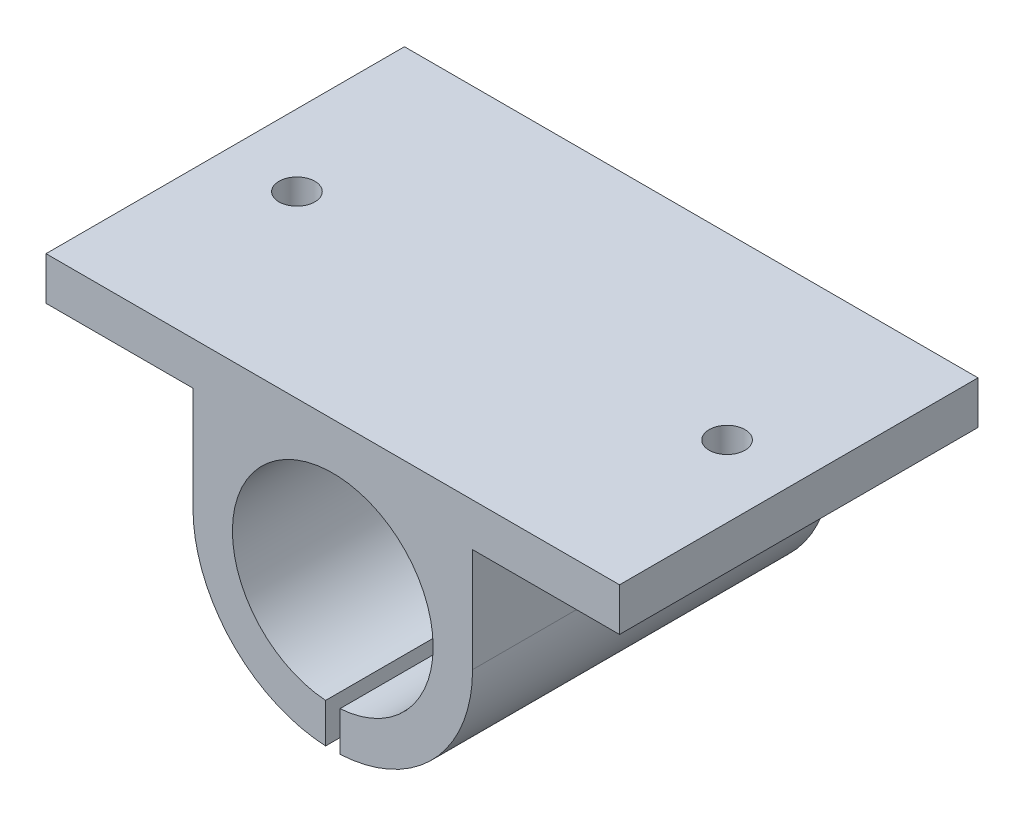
ISO-10303-21;
HEADER;
FILE_DESCRIPTION(('STEP AP214'),'2;1');
FILE_NAME('part.step','',(''),(''),'','','');
FILE_SCHEMA(('AUTOMOTIVE_DESIGN { 1 0 10303 214 1 1 1 1 }'));
ENDSEC;
DATA;
#1=APPLICATION_CONTEXT('core data for automotive mechanical design processes');
#2=APPLICATION_PROTOCOL_DEFINITION('international standard','automotive_design',2000,#1);
#3=PRODUCT_CONTEXT('',#1,'mechanical');
#4=PRODUCT('Part','Part','',(#3));
#5=PRODUCT_RELATED_PRODUCT_CATEGORY('part','',(#4));
#6=PRODUCT_DEFINITION_FORMATION('','',#4);
#7=PRODUCT_DEFINITION_CONTEXT('part definition',#1,'design');
#8=PRODUCT_DEFINITION('design','',#6,#7);
#9=PRODUCT_DEFINITION_SHAPE('','',#8);
#10=(LENGTH_UNIT() NAMED_UNIT(*) SI_UNIT(.MILLI.,.METRE.));
#11=(NAMED_UNIT(*) PLANE_ANGLE_UNIT() SI_UNIT($,.RADIAN.));
#12=(NAMED_UNIT(*) SI_UNIT($,.STERADIAN.) SOLID_ANGLE_UNIT());
#13=UNCERTAINTY_MEASURE_WITH_UNIT(LENGTH_MEASURE(1.E-05),#10,'distance_accuracy_value','');
#14=(GEOMETRIC_REPRESENTATION_CONTEXT(3) GLOBAL_UNCERTAINTY_ASSIGNED_CONTEXT((#13)) GLOBAL_UNIT_ASSIGNED_CONTEXT((#10,
#11,#12)) REPRESENTATION_CONTEXT('',''));
#15=CARTESIAN_POINT('',(0.,0.,0.));
#16=DIRECTION('',(0.,0.,1.));
#17=DIRECTION('',(1.,0.,0.));
#18=AXIS2_PLACEMENT_3D('',#15,#16,#17);
#19=CARTESIAN_POINT('',(0.,0.,25.));
#20=DIRECTION('',(0.,0.,-1.));
#21=DIRECTION('',(-1.,0.,0.));
#22=AXIS2_PLACEMENT_3D('',#19,#20,#21);
#23=CYLINDRICAL_SURFACE('',#22,7.);
#24=CARTESIAN_POINT('',(0.,0.,0.));
#25=DIRECTION('',(0.,0.,-1.));
#26=DIRECTION('',(1.,0.,0.));
#27=AXIS2_PLACEMENT_3D('',#24,#25,#26);
#28=CIRCLE('',#27,7.);
#29=CARTESIAN_POINT('',(-0.499999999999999,-6.98212002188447,0.));
#30=VERTEX_POINT('',#29);
#31=CARTESIAN_POINT('',(0.499999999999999,-6.98212002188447,0.));
#32=VERTEX_POINT('',#31);
#33=EDGE_CURVE('E165',#30,#32,#28,.T.);
#34=ORIENTED_EDGE('',*,*,#33,.T.);
#35=DIRECTION('',(0.,0.,-1.));
#36=VECTOR('',#35,1.);
#37=CARTESIAN_POINT('',(0.499999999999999,-6.98212002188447,25.));
#38=LINE('',#37,#36);
#39=CARTESIAN_POINT('',(0.499999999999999,-6.98212002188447,25.));
#40=VERTEX_POINT('',#39);
#41=EDGE_CURVE('E13',#40,#32,#38,.T.);
#42=ORIENTED_EDGE('',*,*,#41,.F.);
#43=CARTESIAN_POINT('',(0.,0.,25.));
#44=DIRECTION('',(0.,0.,-1.));
#45=DIRECTION('',(1.,0.,0.));
#46=AXIS2_PLACEMENT_3D('',#43,#44,#45);
#47=CIRCLE('',#46,7.);
#48=CARTESIAN_POINT('',(-0.499999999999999,-6.98212002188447,25.));
#49=VERTEX_POINT('',#48);
#50=EDGE_CURVE('E188',#49,#40,#47,.T.);
#51=ORIENTED_EDGE('',*,*,#50,.F.);
#52=DIRECTION('',(0.,0.,-1.));
#53=VECTOR('',#52,1.);
#54=CARTESIAN_POINT('',(-0.499999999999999,-6.98212002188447,25.));
#55=LINE('',#54,#53);
#56=EDGE_CURVE('E161',#49,#30,#55,.T.);
#57=ORIENTED_EDGE('',*,*,#56,.T.);
#58=EDGE_LOOP('',(#34,#42,#51,#57));
#59=FACE_BOUND('',#58,.T.);
#60=ADVANCED_FACE('F44',(#59),#23,.F.);
#61=CARTESIAN_POINT('',(0.499999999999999,-6.98212002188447,25.));
#62=DIRECTION('',(1.,0.,0.));
#63=DIRECTION('',(0.,1.,0.));
#64=AXIS2_PLACEMENT_3D('',#61,#62,#63);
#65=PLANE('',#64);
#66=DIRECTION('',(0.,-1.,0.));
#67=VECTOR('',#66,1.);
#68=CARTESIAN_POINT('',(0.499999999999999,-6.98212002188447,0.));
#69=LINE('',#68,#67);
#70=CARTESIAN_POINT('',(0.499999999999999,-9.73717104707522,0.));
#71=VERTEX_POINT('',#70);
#72=EDGE_CURVE('E168',#32,#71,#69,.T.);
#73=ORIENTED_EDGE('',*,*,#72,.T.);
#74=DIRECTION('',(0.,0.,-1.));
#75=VECTOR('',#74,1.);
#76=CARTESIAN_POINT('',(0.499999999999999,-9.73717104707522,25.));
#77=LINE('',#76,#75);
#78=CARTESIAN_POINT('',(0.499999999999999,-9.73717104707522,25.));
#79=VERTEX_POINT('',#78);
#80=EDGE_CURVE('E53',#79,#71,#77,.T.);
#81=ORIENTED_EDGE('',*,*,#80,.F.);
#82=DIRECTION('',(0.,-1.,0.));
#83=VECTOR('',#82,1.);
#84=CARTESIAN_POINT('',(0.499999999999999,-6.98212002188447,25.));
#85=LINE('',#84,#83);
#86=EDGE_CURVE('E116',#40,#79,#85,.T.);
#87=ORIENTED_EDGE('',*,*,#86,.F.);
#88=ORIENTED_EDGE('',*,*,#41,.T.);
#89=EDGE_LOOP('',(#73,#81,#87,#88));
#90=FACE_BOUND('',#89,.T.);
#91=ADVANCED_FACE('F267',(#90),#65,.F.);
#92=CARTESIAN_POINT('',(0.,0.,25.));
#93=DIRECTION('',(0.,0.,-1.));
#94=DIRECTION('',(-1.,0.,0.));
#95=AXIS2_PLACEMENT_3D('',#92,#93,#94);
#96=CYLINDRICAL_SURFACE('',#95,9.75);
#97=CARTESIAN_POINT('',(0.,0.,0.));
#98=DIRECTION('',(0.,0.,1.));
#99=DIRECTION('',(1.,0.,0.));
#100=AXIS2_PLACEMENT_3D('',#97,#98,#99);
#101=CIRCLE('',#100,9.75);
#102=CARTESIAN_POINT('',(9.75,0.,0.));
#103=VERTEX_POINT('',#102);
#104=EDGE_CURVE('E171',#71,#103,#101,.T.);
#105=ORIENTED_EDGE('',*,*,#104,.T.);
#106=DIRECTION('',(0.,0.,-1.));
#107=VECTOR('',#106,1.);
#108=CARTESIAN_POINT('',(9.75,0.,25.));
#109=LINE('',#108,#107);
#110=CARTESIAN_POINT('',(9.75,0.,25.));
#111=VERTEX_POINT('',#110);
#112=EDGE_CURVE('E207',#111,#103,#109,.T.);
#113=ORIENTED_EDGE('',*,*,#112,.F.);
#114=CARTESIAN_POINT('',(0.,0.,25.));
#115=DIRECTION('',(0.,0.,1.));
#116=DIRECTION('',(1.,0.,0.));
#117=AXIS2_PLACEMENT_3D('',#114,#115,#116);
#118=CIRCLE('',#117,9.75);
#119=EDGE_CURVE('E216',#79,#111,#118,.T.);
#120=ORIENTED_EDGE('',*,*,#119,.F.);
#121=ORIENTED_EDGE('',*,*,#80,.T.);
#122=EDGE_LOOP('',(#105,#113,#120,#121));
#123=FACE_BOUND('',#122,.T.);
#124=ADVANCED_FACE('F214',(#123),#96,.T.);
#125=CARTESIAN_POINT('',(9.75,0.,25.));
#126=DIRECTION('',(-1.,0.,0.));
#127=DIRECTION('',(0.,-1.,0.));
#128=AXIS2_PLACEMENT_3D('',#125,#126,#127);
#129=PLANE('',#128);
#130=DIRECTION('',(0.,1.,0.));
#131=VECTOR('',#130,1.);
#132=CARTESIAN_POINT('',(9.75,0.,0.));
#133=LINE('',#132,#131);
#134=CARTESIAN_POINT('',(9.75,7.25,0.));
#135=VERTEX_POINT('',#134);
#136=EDGE_CURVE('E173',#103,#135,#133,.T.);
#137=ORIENTED_EDGE('',*,*,#136,.T.);
#138=DIRECTION('',(0.,0.,-1.));
#139=VECTOR('',#138,1.);
#140=CARTESIAN_POINT('',(9.75,7.25,25.));
#141=LINE('',#140,#139);
#142=CARTESIAN_POINT('',(9.75,7.25,25.));
#143=VERTEX_POINT('',#142);
#144=EDGE_CURVE('E204',#143,#135,#141,.T.);
#145=ORIENTED_EDGE('',*,*,#144,.F.);
#146=DIRECTION('',(0.,1.,0.));
#147=VECTOR('',#146,1.);
#148=CARTESIAN_POINT('',(9.75,0.,25.));
#149=LINE('',#148,#147);
#150=EDGE_CURVE('E234',#111,#143,#149,.T.);
#151=ORIENTED_EDGE('',*,*,#150,.F.);
#152=ORIENTED_EDGE('',*,*,#112,.T.);
#153=EDGE_LOOP('',(#137,#145,#151,#152));
#154=FACE_BOUND('',#153,.T.);
#155=ADVANCED_FACE('F225',(#154),#129,.F.);
#156=CARTESIAN_POINT('',(9.75,7.25,25.));
#157=DIRECTION('',(0.,1.,0.));
#158=DIRECTION('',(0.,0.,1.));
#159=AXIS2_PLACEMENT_3D('',#156,#157,#158);
#160=PLANE('',#159);
#161=CARTESIAN_POINT('',(15.,7.25,12.5));
#162=DIRECTION('',(0.,1.,0.));
#163=DIRECTION('',(0.,0.,1.));
#164=AXIS2_PLACEMENT_3D('',#161,#162,#163);
#165=CIRCLE('',#164,1.25);
#166=CARTESIAN_POINT('',(15.,7.25,13.75));
#167=VERTEX_POINT('',#166);
#168=EDGE_CURVE('E169',#167,#167,#165,.T.);
#169=ORIENTED_EDGE('',*,*,#168,.T.);
#170=EDGE_LOOP('',(#169));
#171=FACE_BOUND('',#170,.T.);
#172=DIRECTION('',(1.,0.,0.));
#173=VECTOR('',#172,1.);
#174=CARTESIAN_POINT('',(9.75,7.25,0.));
#175=LINE('',#174,#173);
#176=CARTESIAN_POINT('',(20.,7.25,0.));
#177=VERTEX_POINT('',#176);
#178=EDGE_CURVE('E175',#135,#177,#175,.T.);
#179=ORIENTED_EDGE('',*,*,#178,.T.);
#180=DIRECTION('',(0.,0.,-1.));
#181=VECTOR('',#180,1.);
#182=CARTESIAN_POINT('',(20.,7.25,25.));
#183=LINE('',#182,#181);
#184=CARTESIAN_POINT('',(20.,7.25,25.));
#185=VERTEX_POINT('',#184);
#186=EDGE_CURVE('E201',#185,#177,#183,.T.);
#187=ORIENTED_EDGE('',*,*,#186,.F.);
#188=DIRECTION('',(1.,0.,0.));
#189=VECTOR('',#188,1.);
#190=CARTESIAN_POINT('',(9.75,7.25,25.));
#191=LINE('',#190,#189);
#192=EDGE_CURVE('E231',#143,#185,#191,.T.);
#193=ORIENTED_EDGE('',*,*,#192,.F.);
#194=ORIENTED_EDGE('',*,*,#144,.T.);
#195=EDGE_LOOP('',(#179,#187,#193,#194));
#196=FACE_BOUND('',#195,.T.);
#197=ADVANCED_FACE('F229',(#171,#196),#160,.F.);
#198=CARTESIAN_POINT('',(20.,10.25,25.));
#199=DIRECTION('',(-1.,0.,0.));
#200=DIRECTION('',(0.,0.,1.));
#201=AXIS2_PLACEMENT_3D('',#198,#199,#200);
#202=PLANE('',#201);
#203=DIRECTION('',(0.,1.,0.));
#204=VECTOR('',#203,1.);
#205=CARTESIAN_POINT('',(20.,10.25,0.));
#206=LINE('',#205,#204);
#207=CARTESIAN_POINT('',(20.,10.25,0.));
#208=VERTEX_POINT('',#207);
#209=EDGE_CURVE('E177',#177,#208,#206,.T.);
#210=ORIENTED_EDGE('',*,*,#209,.T.);
#211=DIRECTION('',(0.,0.,-1.));
#212=VECTOR('',#211,1.);
#213=CARTESIAN_POINT('',(20.,10.25,25.));
#214=LINE('',#213,#212);
#215=CARTESIAN_POINT('',(20.,10.25,25.));
#216=VERTEX_POINT('',#215);
#217=EDGE_CURVE('E198',#216,#208,#214,.T.);
#218=ORIENTED_EDGE('',*,*,#217,.F.);
#219=DIRECTION('',(0.,1.,0.));
#220=VECTOR('',#219,1.);
#221=CARTESIAN_POINT('',(20.,10.25,25.));
#222=LINE('',#221,#220);
#223=EDGE_CURVE('E233',#185,#216,#222,.T.);
#224=ORIENTED_EDGE('',*,*,#223,.F.);
#225=ORIENTED_EDGE('',*,*,#186,.T.);
#226=EDGE_LOOP('',(#210,#218,#224,#225));
#227=FACE_BOUND('',#226,.T.);
#228=ADVANCED_FACE('F280',(#227),#202,.F.);
#229=CARTESIAN_POINT('',(-20.,10.25,25.));
#230=DIRECTION('',(0.,-1.,0.));
#231=DIRECTION('',(0.,0.,-1.));
#232=AXIS2_PLACEMENT_3D('',#229,#230,#231);
#233=PLANE('',#232);
#234=CARTESIAN_POINT('',(-15.,10.25,12.5));
#235=DIRECTION('',(0.,1.,0.));
#236=DIRECTION('',(0.,0.,1.));
#237=AXIS2_PLACEMENT_3D('',#234,#235,#236);
#238=CIRCLE('',#237,1.25);
#239=CARTESIAN_POINT('',(-15.,10.25,13.75));
#240=VERTEX_POINT('',#239);
#241=EDGE_CURVE('E372',#240,#240,#238,.T.);
#242=ORIENTED_EDGE('',*,*,#241,.F.);
#243=EDGE_LOOP('',(#242));
#244=FACE_BOUND('',#243,.T.);
#245=CARTESIAN_POINT('',(15.,10.25,12.5));
#246=DIRECTION('',(0.,1.,0.));
#247=DIRECTION('',(0.,0.,1.));
#248=AXIS2_PLACEMENT_3D('',#245,#246,#247);
#249=CIRCLE('',#248,1.25);
#250=CARTESIAN_POINT('',(15.,10.25,13.75));
#251=VERTEX_POINT('',#250);
#252=EDGE_CURVE('E367',#251,#251,#249,.T.);
#253=ORIENTED_EDGE('',*,*,#252,.F.);
#254=EDGE_LOOP('',(#253));
#255=FACE_BOUND('',#254,.T.);
#256=DIRECTION('',(-1.,0.,0.));
#257=VECTOR('',#256,1.);
#258=CARTESIAN_POINT('',(-20.,10.25,0.));
#259=LINE('',#258,#257);
#260=CARTESIAN_POINT('',(-20.,10.25,0.));
#261=VERTEX_POINT('',#260);
#262=EDGE_CURVE('E179',#208,#261,#259,.T.);
#263=ORIENTED_EDGE('',*,*,#262,.T.);
#264=DIRECTION('',(0.,0.,-1.));
#265=VECTOR('',#264,1.);
#266=CARTESIAN_POINT('',(-20.,10.25,25.));
#267=LINE('',#266,#265);
#268=CARTESIAN_POINT('',(-20.,10.25,25.));
#269=VERTEX_POINT('',#268);
#270=EDGE_CURVE('E195',#269,#261,#267,.T.);
#271=ORIENTED_EDGE('',*,*,#270,.F.);
#272=DIRECTION('',(-1.,0.,0.));
#273=VECTOR('',#272,1.);
#274=CARTESIAN_POINT('',(-20.,10.25,25.));
#275=LINE('',#274,#273);
#276=EDGE_CURVE('E236',#216,#269,#275,.T.);
#277=ORIENTED_EDGE('',*,*,#276,.F.);
#278=ORIENTED_EDGE('',*,*,#217,.T.);
#279=EDGE_LOOP('',(#263,#271,#277,#278));
#280=FACE_BOUND('',#279,.T.);
#281=ADVANCED_FACE('F284',(#244,#255,#280),#233,.F.);
#282=CARTESIAN_POINT('',(-20.,10.25,25.));
#283=DIRECTION('',(1.,0.,0.));
#284=DIRECTION('',(0.,0.,-1.));
#285=AXIS2_PLACEMENT_3D('',#282,#283,#284);
#286=PLANE('',#285);
#287=DIRECTION('',(0.,-1.,0.));
#288=VECTOR('',#287,1.);
#289=CARTESIAN_POINT('',(-20.,10.25,0.));
#290=LINE('',#289,#288);
#291=CARTESIAN_POINT('',(-20.,7.25,0.));
#292=VERTEX_POINT('',#291);
#293=EDGE_CURVE('E181',#261,#292,#290,.T.);
#294=ORIENTED_EDGE('',*,*,#293,.T.);
#295=DIRECTION('',(0.,0.,-1.));
#296=VECTOR('',#295,1.);
#297=CARTESIAN_POINT('',(-20.,7.25,25.));
#298=LINE('',#297,#296);
#299=CARTESIAN_POINT('',(-20.,7.25,25.));
#300=VERTEX_POINT('',#299);
#301=EDGE_CURVE('E192',#300,#292,#298,.T.);
#302=ORIENTED_EDGE('',*,*,#301,.F.);
#303=DIRECTION('',(0.,-1.,0.));
#304=VECTOR('',#303,1.);
#305=CARTESIAN_POINT('',(-20.,10.25,25.));
#306=LINE('',#305,#304);
#307=EDGE_CURVE('E242',#269,#300,#306,.T.);
#308=ORIENTED_EDGE('',*,*,#307,.F.);
#309=ORIENTED_EDGE('',*,*,#270,.T.);
#310=EDGE_LOOP('',(#294,#302,#308,#309));
#311=FACE_BOUND('',#310,.T.);
#312=ADVANCED_FACE('F248',(#311),#286,.F.);
#313=CARTESIAN_POINT('',(-20.,7.25,25.));
#314=DIRECTION('',(0.,1.,0.));
#315=DIRECTION('',(0.,0.,1.));
#316=AXIS2_PLACEMENT_3D('',#313,#314,#315);
#317=PLANE('',#316);
#318=CARTESIAN_POINT('',(-15.,7.25,12.5));
#319=DIRECTION('',(0.,1.,0.));
#320=DIRECTION('',(0.,0.,1.));
#321=AXIS2_PLACEMENT_3D('',#318,#319,#320);
#322=CIRCLE('',#321,1.25);
#323=CARTESIAN_POINT('',(-15.,7.25,13.75));
#324=VERTEX_POINT('',#323);
#325=EDGE_CURVE('E47',#324,#324,#322,.T.);
#326=ORIENTED_EDGE('',*,*,#325,.T.);
#327=EDGE_LOOP('',(#326));
#328=FACE_BOUND('',#327,.T.);
#329=DIRECTION('',(1.,0.,0.));
#330=VECTOR('',#329,1.);
#331=CARTESIAN_POINT('',(-20.,7.25,0.));
#332=LINE('',#331,#330);
#333=CARTESIAN_POINT('',(-9.75,7.25,0.));
#334=VERTEX_POINT('',#333);
#335=EDGE_CURVE('E183',#292,#334,#332,.T.);
#336=ORIENTED_EDGE('',*,*,#335,.T.);
#337=DIRECTION('',(0.,0.,-1.));
#338=VECTOR('',#337,1.);
#339=CARTESIAN_POINT('',(-9.75,7.25,25.));
#340=LINE('',#339,#338);
#341=CARTESIAN_POINT('',(-9.75,7.25,25.));
#342=VERTEX_POINT('',#341);
#343=EDGE_CURVE('E156',#342,#334,#340,.T.);
#344=ORIENTED_EDGE('',*,*,#343,.F.);
#345=DIRECTION('',(1.,0.,0.));
#346=VECTOR('',#345,1.);
#347=CARTESIAN_POINT('',(-20.,7.25,25.));
#348=LINE('',#347,#346);
#349=EDGE_CURVE('E147',#300,#342,#348,.T.);
#350=ORIENTED_EDGE('',*,*,#349,.F.);
#351=ORIENTED_EDGE('',*,*,#301,.T.);
#352=EDGE_LOOP('',(#336,#344,#350,#351));
#353=FACE_BOUND('',#352,.T.);
#354=ADVANCED_FACE('F252',(#328,#353),#317,.F.);
#355=CARTESIAN_POINT('',(-9.75,0.,25.));
#356=DIRECTION('',(1.,0.,0.));
#357=DIRECTION('',(0.,0.,-1.));
#358=AXIS2_PLACEMENT_3D('',#355,#356,#357);
#359=PLANE('',#358);
#360=DIRECTION('',(0.,-1.,0.));
#361=VECTOR('',#360,1.);
#362=CARTESIAN_POINT('',(-9.75,0.,0.));
#363=LINE('',#362,#361);
#364=CARTESIAN_POINT('',(-9.75,0.,0.));
#365=VERTEX_POINT('',#364);
#366=EDGE_CURVE('E155',#334,#365,#363,.T.);
#367=ORIENTED_EDGE('',*,*,#366,.T.);
#368=DIRECTION('',(0.,0.,-1.));
#369=VECTOR('',#368,1.);
#370=CARTESIAN_POINT('',(-9.75,0.,25.));
#371=LINE('',#370,#369);
#372=CARTESIAN_POINT('',(-9.75,0.,25.));
#373=VERTEX_POINT('',#372);
#374=EDGE_CURVE('E152',#373,#365,#371,.T.);
#375=ORIENTED_EDGE('',*,*,#374,.F.);
#376=DIRECTION('',(0.,-1.,0.));
#377=VECTOR('',#376,1.);
#378=CARTESIAN_POINT('',(-9.75,0.,25.));
#379=LINE('',#378,#377);
#380=EDGE_CURVE('E141',#342,#373,#379,.T.);
#381=ORIENTED_EDGE('',*,*,#380,.F.);
#382=ORIENTED_EDGE('',*,*,#343,.T.);
#383=EDGE_LOOP('',(#367,#375,#381,#382));
#384=FACE_BOUND('',#383,.T.);
#385=ADVANCED_FACE('F153',(#384),#359,.F.);
#386=CARTESIAN_POINT('',(0.,0.,25.));
#387=DIRECTION('',(0.,0.,-1.));
#388=DIRECTION('',(-1.,0.,0.));
#389=AXIS2_PLACEMENT_3D('',#386,#387,#388);
#390=CYLINDRICAL_SURFACE('',#389,9.75);
#391=CARTESIAN_POINT('',(0.,0.,0.));
#392=DIRECTION('',(0.,0.,1.));
#393=DIRECTION('',(1.,0.,0.));
#394=AXIS2_PLACEMENT_3D('',#391,#392,#393);
#395=CIRCLE('',#394,9.75);
#396=CARTESIAN_POINT('',(-0.5,-9.73717104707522,0.));
#397=VERTEX_POINT('',#396);
#398=EDGE_CURVE('E102',#365,#397,#395,.T.);
#399=ORIENTED_EDGE('',*,*,#398,.T.);
#400=DIRECTION('',(0.,0.,-1.));
#401=VECTOR('',#400,1.);
#402=CARTESIAN_POINT('',(-0.5,-9.73717104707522,25.));
#403=LINE('',#402,#401);
#404=CARTESIAN_POINT('',(-0.5,-9.73717104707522,25.));
#405=VERTEX_POINT('',#404);
#406=EDGE_CURVE('E157',#405,#397,#403,.T.);
#407=ORIENTED_EDGE('',*,*,#406,.F.);
#408=CARTESIAN_POINT('',(0.,0.,25.));
#409=DIRECTION('',(0.,0.,1.));
#410=DIRECTION('',(1.,0.,0.));
#411=AXIS2_PLACEMENT_3D('',#408,#409,#410);
#412=CIRCLE('',#411,9.75);
#413=EDGE_CURVE('E145',#373,#405,#412,.T.);
#414=ORIENTED_EDGE('',*,*,#413,.F.);
#415=ORIENTED_EDGE('',*,*,#374,.T.);
#416=EDGE_LOOP('',(#399,#407,#414,#415));
#417=FACE_BOUND('',#416,.T.);
#418=ADVANCED_FACE('F159',(#417),#390,.T.);
#419=CARTESIAN_POINT('',(-0.499999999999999,-6.98212002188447,25.));
#420=DIRECTION('',(-1.,0.,0.));
#421=DIRECTION('',(0.,-1.,0.));
#422=AXIS2_PLACEMENT_3D('',#419,#420,#421);
#423=PLANE('',#422);
#424=DIRECTION('',(0.,1.,0.));
#425=VECTOR('',#424,1.);
#426=CARTESIAN_POINT('',(-0.499999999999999,-6.98212002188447,0.));
#427=LINE('',#426,#425);
#428=EDGE_CURVE('E108',#397,#30,#427,.T.);
#429=ORIENTED_EDGE('',*,*,#428,.T.);
#430=ORIENTED_EDGE('',*,*,#56,.F.);
#431=DIRECTION('',(0.,1.,0.));
#432=VECTOR('',#431,1.);
#433=CARTESIAN_POINT('',(-0.499999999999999,-6.98212002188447,25.));
#434=LINE('',#433,#432);
#435=EDGE_CURVE('E61',#405,#49,#434,.T.);
#436=ORIENTED_EDGE('',*,*,#435,.F.);
#437=ORIENTED_EDGE('',*,*,#406,.T.);
#438=EDGE_LOOP('',(#429,#430,#436,#437));
#439=FACE_BOUND('',#438,.T.);
#440=ADVANCED_FACE('F256',(#439),#423,.F.);
#441=CARTESIAN_POINT('',(0.,0.,25.));
#442=DIRECTION('',(0.,0.,1.));
#443=DIRECTION('',(1.,0.,0.));
#444=AXIS2_PLACEMENT_3D('',#441,#442,#443);
#445=PLANE('',#444);
#446=ORIENTED_EDGE('',*,*,#50,.T.);
#447=ORIENTED_EDGE('',*,*,#86,.T.);
#448=ORIENTED_EDGE('',*,*,#119,.T.);
#449=ORIENTED_EDGE('',*,*,#150,.T.);
#450=ORIENTED_EDGE('',*,*,#192,.T.);
#451=ORIENTED_EDGE('',*,*,#223,.T.);
#452=ORIENTED_EDGE('',*,*,#276,.T.);
#453=ORIENTED_EDGE('',*,*,#307,.T.);
#454=ORIENTED_EDGE('',*,*,#349,.T.);
#455=ORIENTED_EDGE('',*,*,#380,.T.);
#456=ORIENTED_EDGE('',*,*,#413,.T.);
#457=ORIENTED_EDGE('',*,*,#435,.T.);
#458=EDGE_LOOP('',(#446,#447,#448,#449,#450,#451,#452,#453,#454,#455,#456,#457));
#459=FACE_BOUND('',#458,.T.);
#460=ADVANCED_FACE('F143',(#459),#445,.T.);
#461=CARTESIAN_POINT('',(0.,0.,0.));
#462=DIRECTION('',(0.,0.,1.));
#463=DIRECTION('',(1.,0.,0.));
#464=AXIS2_PLACEMENT_3D('',#461,#462,#463);
#465=PLANE('',#464);
#466=ORIENTED_EDGE('',*,*,#33,.F.);
#467=ORIENTED_EDGE('',*,*,#428,.F.);
#468=ORIENTED_EDGE('',*,*,#398,.F.);
#469=ORIENTED_EDGE('',*,*,#366,.F.);
#470=ORIENTED_EDGE('',*,*,#335,.F.);
#471=ORIENTED_EDGE('',*,*,#293,.F.);
#472=ORIENTED_EDGE('',*,*,#262,.F.);
#473=ORIENTED_EDGE('',*,*,#209,.F.);
#474=ORIENTED_EDGE('',*,*,#178,.F.);
#475=ORIENTED_EDGE('',*,*,#136,.F.);
#476=ORIENTED_EDGE('',*,*,#104,.F.);
#477=ORIENTED_EDGE('',*,*,#72,.F.);
#478=EDGE_LOOP('',(#466,#467,#468,#469,#470,#471,#472,#473,#474,#475,#476,#477));
#479=FACE_BOUND('',#478,.T.);
#480=ADVANCED_FACE('F220',(#479),#465,.F.);
#481=CARTESIAN_POINT('',(-15.,-1.75,12.5));
#482=DIRECTION('',(0.,1.,0.));
#483=DIRECTION('',(0.,0.,1.));
#484=AXIS2_PLACEMENT_3D('',#481,#482,#483);
#485=CYLINDRICAL_SURFACE('',#484,1.25);
#486=ORIENTED_EDGE('',*,*,#241,.T.);
#487=EDGE_LOOP('',(#486));
#488=FACE_BOUND('',#487,.T.);
#489=ORIENTED_EDGE('',*,*,#325,.F.);
#490=EDGE_LOOP('',(#489));
#491=FACE_BOUND('',#490,.T.);
#492=ADVANCED_FACE('F323',(#488,#491),#485,.F.);
#493=CARTESIAN_POINT('',(15.,-1.75,12.5));
#494=DIRECTION('',(0.,1.,0.));
#495=DIRECTION('',(0.,0.,1.));
#496=AXIS2_PLACEMENT_3D('',#493,#494,#495);
#497=CYLINDRICAL_SURFACE('',#496,1.25);
#498=ORIENTED_EDGE('',*,*,#252,.T.);
#499=EDGE_LOOP('',(#498));
#500=FACE_BOUND('',#499,.T.);
#501=ORIENTED_EDGE('',*,*,#168,.F.);
#502=EDGE_LOOP('',(#501));
#503=FACE_BOUND('',#502,.T.);
#504=ADVANCED_FACE('F350',(#500,#503),#497,.F.);
#505=CLOSED_SHELL('',(#60,#91,#124,#155,#197,#228,#281,#312,#354,#385,#418,#440,#460,#480,#492,#504));
#506=MANIFOLD_SOLID_BREP('B2',#505);
#507=ADVANCED_BREP_SHAPE_REPRESENTATION('',(#18,#506),#14);
#508=SHAPE_DEFINITION_REPRESENTATION(#9,#507);
ENDSEC;
END-ISO-10303-21;
